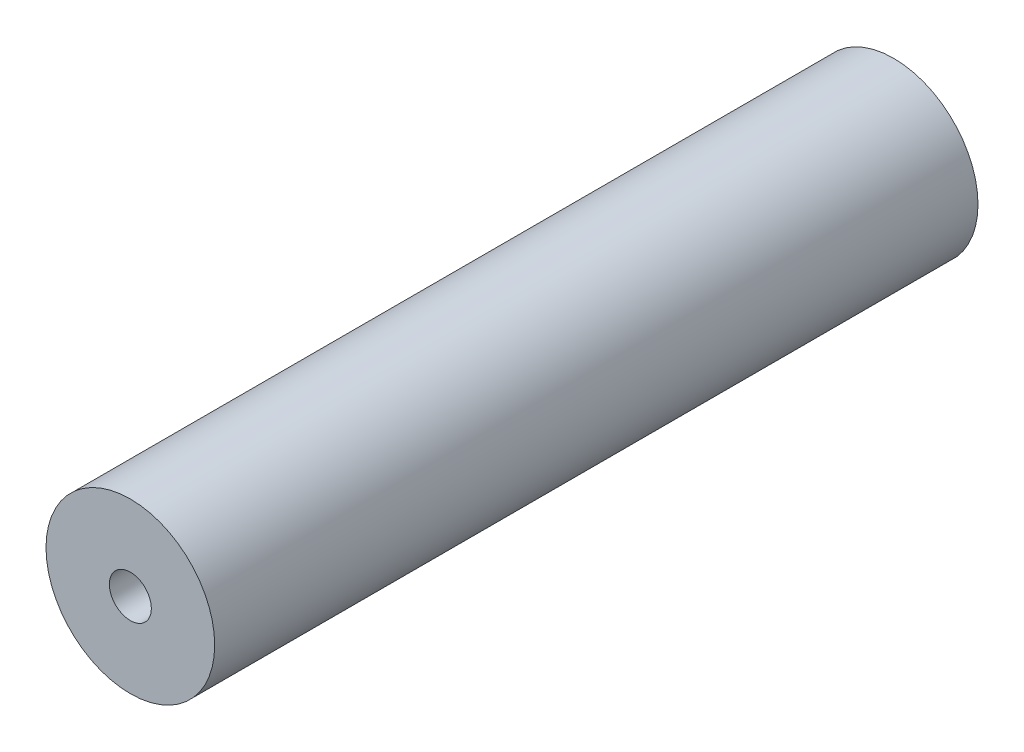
from build123d import *

# Parameters (mm, degrees)
SKETCH1_R           = 10
SKETCH1_R_2         = 2.4892
BOSS_EXTRUDE1_DEPTH = 90.5


with BuildPart() as part:
    # Sketch1 → Boss-Extrude1 (new body)
    with BuildSketch(Plane.XY):
        with Locations((226.452282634, 84.2)):
            Circle(SKETCH1_R)
        with Locations((226.452282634, 84.2)):
            Circle(SKETCH1_R_2, mode=Mode.SUBTRACT)
    extrude(amount=BOSS_EXTRUDE1_DEPTH)


solid = part.part
